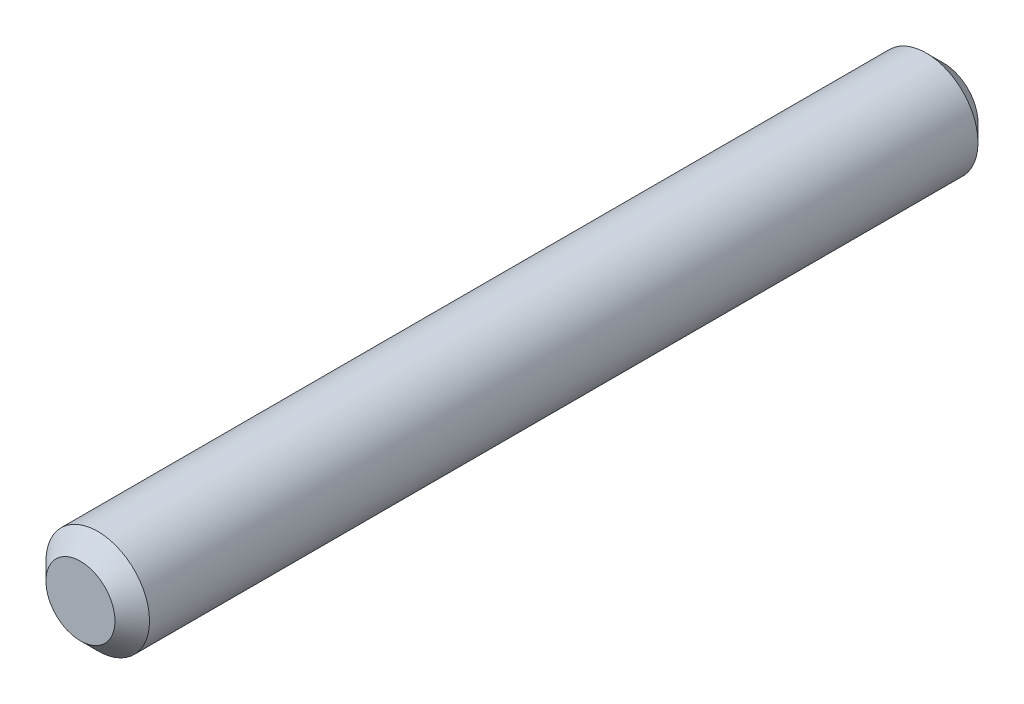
from build123d import *

# Parameters (mm, degrees)
ESQUISSE1_R      = 3
EXTRUSION1_DEPTH = 50
CHANFREIN1_SIZE  = 1


with BuildPart() as part:
    # Esquisse1 → Extrusion1 (new body)
    with BuildSketch(Plane.XY):
        Circle(ESQUISSE1_R)
    extrude(amount=EXTRUSION1_DEPTH)

    # Chanfrein1
    chanfrein1_edges = [part.edges().sort_by_distance(p)[0] for p in [
        (-3, 0, 0),
        (-3, 0, 50),
    ]]
    chamfer(chanfrein1_edges, length=CHANFREIN1_SIZE)


solid = part.part
